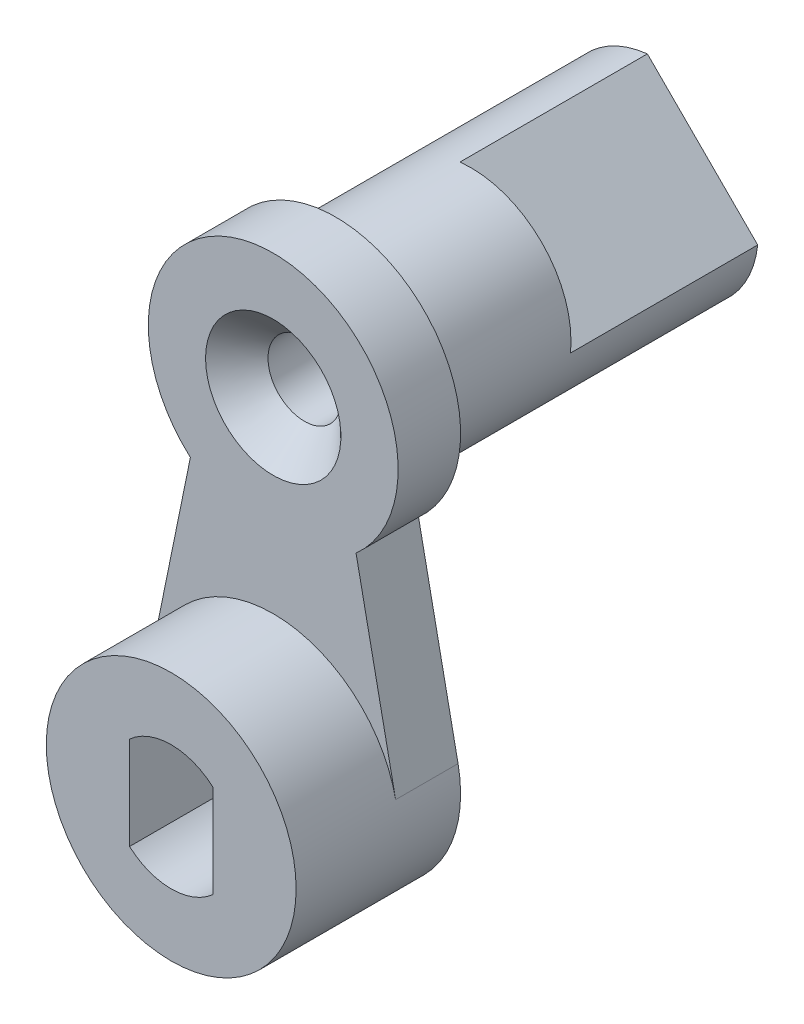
ISO-10303-21;
HEADER;
FILE_DESCRIPTION(('STEP AP214'),'2;1');
FILE_NAME('part.step','',(''),(''),'','','');
FILE_SCHEMA(('AUTOMOTIVE_DESIGN { 1 0 10303 214 1 1 1 1 }'));
ENDSEC;
DATA;
#1=APPLICATION_CONTEXT('core data for automotive mechanical design processes');
#2=APPLICATION_PROTOCOL_DEFINITION('international standard','automotive_design',2000,#1);
#3=PRODUCT_CONTEXT('',#1,'mechanical');
#4=PRODUCT('Part','Part','',(#3));
#5=PRODUCT_RELATED_PRODUCT_CATEGORY('part','',(#4));
#6=PRODUCT_DEFINITION_FORMATION('','',#4);
#7=PRODUCT_DEFINITION_CONTEXT('part definition',#1,'design');
#8=PRODUCT_DEFINITION('design','',#6,#7);
#9=PRODUCT_DEFINITION_SHAPE('','',#8);
#10=(LENGTH_UNIT() NAMED_UNIT(*) SI_UNIT(.MILLI.,.METRE.));
#11=(NAMED_UNIT(*) PLANE_ANGLE_UNIT() SI_UNIT($,.RADIAN.));
#12=(NAMED_UNIT(*) SI_UNIT($,.STERADIAN.) SOLID_ANGLE_UNIT());
#13=UNCERTAINTY_MEASURE_WITH_UNIT(LENGTH_MEASURE(1.E-05),#10,'distance_accuracy_value','');
#14=(GEOMETRIC_REPRESENTATION_CONTEXT(3) GLOBAL_UNCERTAINTY_ASSIGNED_CONTEXT((#13)) GLOBAL_UNIT_ASSIGNED_CONTEXT((#10,
#11,#12)) REPRESENTATION_CONTEXT('',''));
#15=CARTESIAN_POINT('',(0.,0.,0.));
#16=DIRECTION('',(0.,0.,1.));
#17=DIRECTION('',(1.,0.,0.));
#18=AXIS2_PLACEMENT_3D('',#15,#16,#17);
#19=CARTESIAN_POINT('',(0.,15.,-6.5));
#20=DIRECTION('',(0.,0.,-1.));
#21=DIRECTION('',(-1.,0.,0.));
#22=AXIS2_PLACEMENT_3D('',#19,#20,#21);
#23=PLANE('',#22);
#24=CARTESIAN_POINT('',(0.,15.,-6.5));
#25=DIRECTION('',(0.,0.,-1.));
#26=DIRECTION('',(-1.,0.,0.));
#27=AXIS2_PLACEMENT_3D('',#24,#25,#26);
#28=CIRCLE('',#27,4.8);
#29=CARTESIAN_POINT('',(-0.528207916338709,19.770848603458,-6.5));
#30=VERTEX_POINT('',#29);
#31=CARTESIAN_POINT('',(4.770848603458,14.4717920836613,-6.5));
#32=VERTEX_POINT('',#31);
#33=EDGE_CURVE('E58',#30,#32,#28,.T.);
#34=ORIENTED_EDGE('',*,*,#33,.T.);
#35=DIRECTION('',(-0.707106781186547,0.707106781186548,0.));
#36=VECTOR('',#35,1.);
#37=CARTESIAN_POINT('',(9.62132034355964,9.62132034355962,-6.5));
#38=LINE('',#37,#36);
#39=EDGE_CURVE('E145',#32,#30,#38,.T.);
#40=ORIENTED_EDGE('',*,*,#39,.T.);
#41=EDGE_LOOP('',(#34,#40));
#42=FACE_BOUND('',#41,.T.);
#43=ADVANCED_FACE('F36',(#42),#23,.T.);
#44=CARTESIAN_POINT('',(0.,0.,0.));
#45=DIRECTION('',(0.,0.,1.));
#46=DIRECTION('',(1.,0.,0.));
#47=AXIS2_PLACEMENT_3D('',#44,#45,#46);
#48=PLANE('',#47);
#49=CARTESIAN_POINT('',(0.,0.,0.));
#50=DIRECTION('',(0.,0.,1.));
#51=DIRECTION('',(1.,0.,0.));
#52=AXIS2_PLACEMENT_3D('',#49,#50,#51);
#53=CIRCLE('',#52,3.);
#54=CARTESIAN_POINT('',(2.,2.23606797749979,0.));
#55=VERTEX_POINT('',#54);
#56=CARTESIAN_POINT('',(-2.,2.23606797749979,0.));
#57=VERTEX_POINT('',#56);
#58=EDGE_CURVE('E179',#55,#57,#53,.T.);
#59=ORIENTED_EDGE('',*,*,#58,.T.);
#60=DIRECTION('',(0.,-1.,0.));
#61=VECTOR('',#60,1.);
#62=CARTESIAN_POINT('',(-2.,2.23606797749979,0.));
#63=LINE('',#62,#61);
#64=CARTESIAN_POINT('',(-2.,-2.23606797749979,0.));
#65=VERTEX_POINT('',#64);
#66=EDGE_CURVE('E200',#57,#65,#63,.T.);
#67=ORIENTED_EDGE('',*,*,#66,.T.);
#68=CARTESIAN_POINT('',(0.,0.,0.));
#69=DIRECTION('',(0.,0.,1.));
#70=DIRECTION('',(1.,0.,0.));
#71=AXIS2_PLACEMENT_3D('',#68,#69,#70);
#72=CIRCLE('',#71,3.);
#73=CARTESIAN_POINT('',(2.,-2.23606797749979,0.));
#74=VERTEX_POINT('',#73);
#75=EDGE_CURVE('E203',#65,#74,#72,.T.);
#76=ORIENTED_EDGE('',*,*,#75,.T.);
#77=DIRECTION('',(0.,1.,0.));
#78=VECTOR('',#77,1.);
#79=CARTESIAN_POINT('',(2.,2.23606797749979,0.));
#80=LINE('',#79,#78);
#81=EDGE_CURVE('E190',#74,#55,#80,.T.);
#82=ORIENTED_EDGE('',*,*,#81,.T.);
#83=EDGE_LOOP('',(#59,#67,#76,#82));
#84=FACE_BOUND('',#83,.T.);
#85=CARTESIAN_POINT('',(0.,0.,0.));
#86=DIRECTION('',(0.,0.,1.));
#87=DIRECTION('',(1.,0.,0.));
#88=AXIS2_PLACEMENT_3D('',#85,#86,#87);
#89=CIRCLE('',#88,6.);
#90=CARTESIAN_POINT('',(-5.87861812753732,1.2007701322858,0.));
#91=VERTEX_POINT('',#90);
#92=CARTESIAN_POINT('',(5.87861812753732,1.2007701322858,0.));
#93=VERTEX_POINT('',#92);
#94=EDGE_CURVE('E217',#91,#93,#89,.T.);
#95=ORIENTED_EDGE('',*,*,#94,.F.);
#96=DIRECTION('',(0.199999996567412,0.979795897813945,0.));
#97=VECTOR('',#96,1.);
#98=CARTESIAN_POINT('',(-5.87877533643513,1.1999999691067,0.));
#99=LINE('',#98,#97);
#100=CARTESIAN_POINT('',(-3.97861816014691,10.5088311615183,0.));
#101=VERTEX_POINT('',#100);
#102=EDGE_CURVE('E172',#91,#101,#99,.T.);
#103=ORIENTED_EDGE('',*,*,#102,.T.);
#104=CARTESIAN_POINT('',(0.,15.,0.));
#105=DIRECTION('',(0.,0.,-1.));
#106=DIRECTION('',(-1.,0.,0.));
#107=AXIS2_PLACEMENT_3D('',#104,#105,#106);
#108=CIRCLE('',#107,6.);
#109=CARTESIAN_POINT('',(3.97861816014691,10.5088311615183,0.));
#110=VERTEX_POINT('',#109);
#111=EDGE_CURVE('E159',#101,#110,#108,.T.);
#112=ORIENTED_EDGE('',*,*,#111,.T.);
#113=DIRECTION('',(-0.199999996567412,0.979795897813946,0.));
#114=VECTOR('',#113,1.);
#115=CARTESIAN_POINT('',(5.87877533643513,1.1999999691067,0.));
#116=LINE('',#115,#114);
#117=EDGE_CURVE('E169',#93,#110,#116,.T.);
#118=ORIENTED_EDGE('',*,*,#117,.F.);
#119=EDGE_LOOP('',(#95,#103,#112,#118));
#120=FACE_BOUND('',#119,.T.);
#121=CARTESIAN_POINT('',(0.,15.,0.));
#122=DIRECTION('',(0.,0.,1.));
#123=DIRECTION('',(1.,0.,0.));
#124=AXIS2_PLACEMENT_3D('',#121,#122,#123);
#125=CIRCLE('',#124,4.8);
#126=CARTESIAN_POINT('',(4.8,15.,0.));
#127=VERTEX_POINT('',#126);
#128=EDGE_CURVE('E221',#127,#127,#125,.F.);
#129=ORIENTED_EDGE('',*,*,#128,.F.);
#130=EDGE_LOOP('',(#129));
#131=FACE_BOUND('',#130,.T.);
#132=ADVANCED_FACE('F239',(#84,#120,#131),#48,.F.);
#133=CARTESIAN_POINT('',(0.,0.,7.9));
#134=DIRECTION('',(0.,0.,1.));
#135=DIRECTION('',(1.,0.,0.));
#136=AXIS2_PLACEMENT_3D('',#133,#134,#135);
#137=PLANE('',#136);
#138=CARTESIAN_POINT('',(0.,0.,7.9));
#139=DIRECTION('',(0.,0.,1.));
#140=DIRECTION('',(1.,0.,0.));
#141=AXIS2_PLACEMENT_3D('',#138,#139,#140);
#142=CIRCLE('',#141,6.);
#143=CARTESIAN_POINT('',(6.,0.,7.9));
#144=VERTEX_POINT('',#143);
#145=EDGE_CURVE('E218',#144,#144,#142,.T.);
#146=ORIENTED_EDGE('',*,*,#145,.T.);
#147=EDGE_LOOP('',(#146));
#148=FACE_BOUND('',#147,.T.);
#149=DIRECTION('',(0.,-1.,0.));
#150=VECTOR('',#149,1.);
#151=CARTESIAN_POINT('',(-2.,2.23606797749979,7.9));
#152=LINE('',#151,#150);
#153=CARTESIAN_POINT('',(-2.,2.23606797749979,7.9));
#154=VERTEX_POINT('',#153);
#155=CARTESIAN_POINT('',(-2.,-2.23606797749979,7.9));
#156=VERTEX_POINT('',#155);
#157=EDGE_CURVE('E189',#154,#156,#152,.T.);
#158=ORIENTED_EDGE('',*,*,#157,.F.);
#159=CARTESIAN_POINT('',(0.,0.,7.9));
#160=DIRECTION('',(0.,0.,1.));
#161=DIRECTION('',(1.,0.,0.));
#162=AXIS2_PLACEMENT_3D('',#159,#160,#161);
#163=CIRCLE('',#162,3.);
#164=CARTESIAN_POINT('',(2.,2.23606797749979,7.9));
#165=VERTEX_POINT('',#164);
#166=EDGE_CURVE('E187',#165,#154,#163,.T.);
#167=ORIENTED_EDGE('',*,*,#166,.F.);
#168=DIRECTION('',(0.,1.,0.));
#169=VECTOR('',#168,1.);
#170=CARTESIAN_POINT('',(2.,2.23606797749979,7.9));
#171=LINE('',#170,#169);
#172=CARTESIAN_POINT('',(2.,-2.23606797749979,7.9));
#173=VERTEX_POINT('',#172);
#174=EDGE_CURVE('E195',#173,#165,#171,.T.);
#175=ORIENTED_EDGE('',*,*,#174,.F.);
#176=CARTESIAN_POINT('',(0.,0.,7.9));
#177=DIRECTION('',(0.,0.,1.));
#178=DIRECTION('',(1.,0.,0.));
#179=AXIS2_PLACEMENT_3D('',#176,#177,#178);
#180=CIRCLE('',#179,3.);
#181=EDGE_CURVE('E192',#156,#173,#180,.T.);
#182=ORIENTED_EDGE('',*,*,#181,.F.);
#183=EDGE_LOOP('',(#158,#167,#175,#182));
#184=FACE_BOUND('',#183,.T.);
#185=ADVANCED_FACE('F245',(#148,#184),#137,.T.);
#186=CARTESIAN_POINT('',(0.,0.,7.9));
#187=DIRECTION('',(0.,0.,-1.));
#188=DIRECTION('',(-1.,0.,0.));
#189=AXIS2_PLACEMENT_3D('',#186,#187,#188);
#190=CYLINDRICAL_SURFACE('',#189,6.);
#191=CARTESIAN_POINT('',(0.,0.,3.));
#192=DIRECTION('',(0.,0.,-1.));
#193=DIRECTION('',(-1.,0.,0.));
#194=AXIS2_PLACEMENT_3D('',#191,#192,#193);
#195=CIRCLE('',#194,6.);
#196=CARTESIAN_POINT('',(-5.87861812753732,1.2007701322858,3.));
#197=VERTEX_POINT('',#196);
#198=CARTESIAN_POINT('',(5.87861812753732,1.2007701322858,3.));
#199=VERTEX_POINT('',#198);
#200=EDGE_CURVE('E158',#197,#199,#195,.T.);
#201=ORIENTED_EDGE('',*,*,#200,.F.);
#202=DIRECTION('',(0.,0.,-1.));
#203=VECTOR('',#202,1.);
#204=CARTESIAN_POINT('',(-5.87861812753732,1.2007701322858,3.));
#205=LINE('',#204,#203);
#206=EDGE_CURVE('E182',#197,#91,#205,.T.);
#207=ORIENTED_EDGE('',*,*,#206,.T.);
#208=ORIENTED_EDGE('',*,*,#94,.T.);
#209=DIRECTION('',(0.,0.,-1.));
#210=VECTOR('',#209,1.);
#211=CARTESIAN_POINT('',(5.87861812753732,1.2007701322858,3.));
#212=LINE('',#211,#210);
#213=EDGE_CURVE('E168',#199,#93,#212,.T.);
#214=ORIENTED_EDGE('',*,*,#213,.F.);
#215=EDGE_LOOP('',(#201,#207,#208,#214));
#216=FACE_BOUND('',#215,.T.);
#217=ORIENTED_EDGE('',*,*,#145,.F.);
#218=EDGE_LOOP('',(#217));
#219=FACE_BOUND('',#218,.T.);
#220=ADVANCED_FACE('F290',(#216,#219),#190,.T.);
#221=CARTESIAN_POINT('',(0.,0.,7.9));
#222=DIRECTION('',(0.,0.,-1.));
#223=DIRECTION('',(-1.,0.,0.));
#224=AXIS2_PLACEMENT_3D('',#221,#222,#223);
#225=CYLINDRICAL_SURFACE('',#224,3.);
#226=ORIENTED_EDGE('',*,*,#58,.F.);
#227=DIRECTION('',(0.,0.,-1.));
#228=VECTOR('',#227,1.);
#229=CARTESIAN_POINT('',(2.,2.23606797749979,7.9));
#230=LINE('',#229,#228);
#231=EDGE_CURVE('E197',#165,#55,#230,.T.);
#232=ORIENTED_EDGE('',*,*,#231,.F.);
#233=ORIENTED_EDGE('',*,*,#166,.T.);
#234=DIRECTION('',(0.,0.,-1.));
#235=VECTOR('',#234,1.);
#236=CARTESIAN_POINT('',(-2.,2.23606797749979,7.9));
#237=LINE('',#236,#235);
#238=EDGE_CURVE('E214',#154,#57,#237,.T.);
#239=ORIENTED_EDGE('',*,*,#238,.T.);
#240=EDGE_LOOP('',(#226,#232,#233,#239));
#241=FACE_BOUND('',#240,.T.);
#242=ADVANCED_FACE('F286',(#241),#225,.F.);
#243=CARTESIAN_POINT('',(-2.,2.23606797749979,7.9));
#244=DIRECTION('',(1.,0.,0.));
#245=DIRECTION('',(0.,0.,-1.));
#246=AXIS2_PLACEMENT_3D('',#243,#244,#245);
#247=PLANE('',#246);
#248=ORIENTED_EDGE('',*,*,#66,.F.);
#249=ORIENTED_EDGE('',*,*,#238,.F.);
#250=ORIENTED_EDGE('',*,*,#157,.T.);
#251=DIRECTION('',(0.,0.,-1.));
#252=VECTOR('',#251,1.);
#253=CARTESIAN_POINT('',(-2.,-2.23606797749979,7.9));
#254=LINE('',#253,#252);
#255=EDGE_CURVE('E212',#156,#65,#254,.T.);
#256=ORIENTED_EDGE('',*,*,#255,.T.);
#257=EDGE_LOOP('',(#248,#249,#250,#256));
#258=FACE_BOUND('',#257,.T.);
#259=ADVANCED_FACE('F282',(#258),#247,.T.);
#260=CARTESIAN_POINT('',(0.,0.,7.9));
#261=DIRECTION('',(0.,0.,-1.));
#262=DIRECTION('',(-1.,0.,0.));
#263=AXIS2_PLACEMENT_3D('',#260,#261,#262);
#264=CYLINDRICAL_SURFACE('',#263,3.);
#265=ORIENTED_EDGE('',*,*,#75,.F.);
#266=ORIENTED_EDGE('',*,*,#255,.F.);
#267=ORIENTED_EDGE('',*,*,#181,.T.);
#268=DIRECTION('',(0.,0.,-1.));
#269=VECTOR('',#268,1.);
#270=CARTESIAN_POINT('',(2.,-2.23606797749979,7.9));
#271=LINE('',#270,#269);
#272=EDGE_CURVE('E210',#173,#74,#271,.T.);
#273=ORIENTED_EDGE('',*,*,#272,.T.);
#274=EDGE_LOOP('',(#265,#266,#267,#273));
#275=FACE_BOUND('',#274,.T.);
#276=ADVANCED_FACE('F278',(#275),#264,.F.);
#277=CARTESIAN_POINT('',(2.,2.23606797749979,7.9));
#278=DIRECTION('',(-1.,0.,0.));
#279=DIRECTION('',(0.,0.,1.));
#280=AXIS2_PLACEMENT_3D('',#277,#278,#279);
#281=PLANE('',#280);
#282=ORIENTED_EDGE('',*,*,#81,.F.);
#283=ORIENTED_EDGE('',*,*,#272,.F.);
#284=ORIENTED_EDGE('',*,*,#174,.T.);
#285=ORIENTED_EDGE('',*,*,#231,.T.);
#286=EDGE_LOOP('',(#282,#283,#284,#285));
#287=FACE_BOUND('',#286,.T.);
#288=ADVANCED_FACE('F273',(#287),#281,.T.);
#289=CARTESIAN_POINT('',(5.87877533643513,1.1999999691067,3.));
#290=DIRECTION('',(-0.979795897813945,-0.199999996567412,0.));
#291=DIRECTION('',(0.199999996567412,-0.979795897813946,0.));
#292=AXIS2_PLACEMENT_3D('',#289,#290,#291);
#293=PLANE('',#292);
#294=ORIENTED_EDGE('',*,*,#117,.T.);
#295=DIRECTION('',(0.,0.,-1.));
#296=VECTOR('',#295,1.);
#297=CARTESIAN_POINT('',(3.97861816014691,10.5088311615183,3.));
#298=LINE('',#297,#296);
#299=CARTESIAN_POINT('',(3.97861816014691,10.5088311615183,3.));
#300=VERTEX_POINT('',#299);
#301=EDGE_CURVE('E177',#300,#110,#298,.T.);
#302=ORIENTED_EDGE('',*,*,#301,.F.);
#303=DIRECTION('',(-0.199999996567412,0.979795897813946,0.));
#304=VECTOR('',#303,1.);
#305=CARTESIAN_POINT('',(5.87877533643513,1.1999999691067,3.));
#306=LINE('',#305,#304);
#307=EDGE_CURVE('E156',#199,#300,#306,.T.);
#308=ORIENTED_EDGE('',*,*,#307,.F.);
#309=ORIENTED_EDGE('',*,*,#213,.T.);
#310=EDGE_LOOP('',(#294,#302,#308,#309));
#311=FACE_BOUND('',#310,.T.);
#312=ADVANCED_FACE('F267',(#311),#293,.F.);
#313=CARTESIAN_POINT('',(0.,15.,3.));
#314=DIRECTION('',(0.,0.,-1.));
#315=DIRECTION('',(-1.,0.,0.));
#316=AXIS2_PLACEMENT_3D('',#313,#314,#315);
#317=CYLINDRICAL_SURFACE('',#316,6.);
#318=ORIENTED_EDGE('',*,*,#111,.F.);
#319=DIRECTION('',(0.,0.,-1.));
#320=VECTOR('',#319,1.);
#321=CARTESIAN_POINT('',(-3.97861816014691,10.5088311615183,3.));
#322=LINE('',#321,#320);
#323=CARTESIAN_POINT('',(-3.97861816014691,10.5088311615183,3.));
#324=VERTEX_POINT('',#323);
#325=EDGE_CURVE('E180',#324,#101,#322,.T.);
#326=ORIENTED_EDGE('',*,*,#325,.F.);
#327=CARTESIAN_POINT('',(0.,15.,3.));
#328=DIRECTION('',(0.,0.,-1.));
#329=DIRECTION('',(-1.,0.,0.));
#330=AXIS2_PLACEMENT_3D('',#327,#328,#329);
#331=CIRCLE('',#330,6.);
#332=EDGE_CURVE('E165',#324,#300,#331,.T.);
#333=ORIENTED_EDGE('',*,*,#332,.T.);
#334=ORIENTED_EDGE('',*,*,#301,.T.);
#335=EDGE_LOOP('',(#318,#326,#333,#334));
#336=FACE_BOUND('',#335,.T.);
#337=ADVANCED_FACE('F264',(#336),#317,.T.);
#338=CARTESIAN_POINT('',(-5.87877533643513,1.1999999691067,3.));
#339=DIRECTION('',(-0.979795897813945,0.199999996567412,0.));
#340=DIRECTION('',(-0.199999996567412,-0.979795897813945,0.));
#341=AXIS2_PLACEMENT_3D('',#338,#339,#340);
#342=PLANE('',#341);
#343=ORIENTED_EDGE('',*,*,#102,.F.);
#344=ORIENTED_EDGE('',*,*,#206,.F.);
#345=DIRECTION('',(0.199999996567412,0.979795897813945,0.));
#346=VECTOR('',#345,1.);
#347=CARTESIAN_POINT('',(-5.87877533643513,1.1999999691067,3.));
#348=LINE('',#347,#346);
#349=EDGE_CURVE('E162',#197,#324,#348,.T.);
#350=ORIENTED_EDGE('',*,*,#349,.T.);
#351=ORIENTED_EDGE('',*,*,#325,.T.);
#352=EDGE_LOOP('',(#343,#344,#350,#351));
#353=FACE_BOUND('',#352,.T.);
#354=ADVANCED_FACE('F260',(#353),#342,.T.);
#355=CARTESIAN_POINT('',(0.,15.,3.));
#356=DIRECTION('',(0.,0.,-1.));
#357=DIRECTION('',(-1.,0.,0.));
#358=AXIS2_PLACEMENT_3D('',#355,#356,#357);
#359=CYLINDRICAL_SURFACE('',#358,1.75);
#360=CARTESIAN_POINT('',(0.,15.,1.5));
#361=DIRECTION('',(0.,0.,-1.));
#362=DIRECTION('',(-1.,0.,0.));
#363=AXIS2_PLACEMENT_3D('',#360,#361,#362);
#364=CIRCLE('',#363,1.75);
#365=CARTESIAN_POINT('',(-1.75,15.,1.5));
#366=VERTEX_POINT('',#365);
#367=EDGE_CURVE('E11',#366,#366,#364,.F.);
#368=ORIENTED_EDGE('',*,*,#367,.T.);
#369=EDGE_LOOP('',(#368));
#370=FACE_BOUND('',#369,.T.);
#371=CARTESIAN_POINT('',(0.,15.,-15.5));
#372=DIRECTION('',(0.,0.,-1.));
#373=DIRECTION('',(-1.,0.,0.));
#374=AXIS2_PLACEMENT_3D('',#371,#372,#373);
#375=CIRCLE('',#374,1.75);
#376=CARTESIAN_POINT('',(-1.75,15.,-15.5));
#377=VERTEX_POINT('',#376);
#378=EDGE_CURVE('E467',#377,#377,#375,.F.);
#379=ORIENTED_EDGE('',*,*,#378,.F.);
#380=EDGE_LOOP('',(#379));
#381=FACE_BOUND('',#380,.T.);
#382=ADVANCED_FACE('F255',(#370,#381),#359,.F.);
#383=CARTESIAN_POINT('',(0.,0.,3.));
#384=DIRECTION('',(0.,0.,-1.));
#385=DIRECTION('',(-1.,0.,0.));
#386=AXIS2_PLACEMENT_3D('',#383,#384,#385);
#387=PLANE('',#386);
#388=CARTESIAN_POINT('',(0.,15.,3.));
#389=DIRECTION('',(0.,0.,-1.));
#390=DIRECTION('',(-1.,0.,0.));
#391=AXIS2_PLACEMENT_3D('',#388,#389,#390);
#392=CIRCLE('',#391,3.24999999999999);
#393=CARTESIAN_POINT('',(-3.24999999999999,15.,3.));
#394=VERTEX_POINT('',#393);
#395=EDGE_CURVE('E45',#394,#394,#392,.T.);
#396=ORIENTED_EDGE('',*,*,#395,.T.);
#397=EDGE_LOOP('',(#396));
#398=FACE_BOUND('',#397,.T.);
#399=ORIENTED_EDGE('',*,*,#307,.T.);
#400=ORIENTED_EDGE('',*,*,#332,.F.);
#401=ORIENTED_EDGE('',*,*,#349,.F.);
#402=ORIENTED_EDGE('',*,*,#200,.T.);
#403=EDGE_LOOP('',(#399,#400,#401,#402));
#404=FACE_BOUND('',#403,.T.);
#405=ADVANCED_FACE('F227',(#398,#404),#387,.F.);
#406=DIRECTION('',(-0.707106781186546,0.70710678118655,0.));
#407=VECTOR('',#406,1.);
#408=CARTESIAN_POINT('',(5.37867965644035,5.37867965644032,-6.5));
#409=LINE('',#408,#407);
#410=CARTESIAN_POINT('',(0.528207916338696,10.229151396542,-6.5));
#411=VERTEX_POINT('',#410);
#412=CARTESIAN_POINT('',(-4.77084860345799,15.5282079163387,-6.5));
#413=VERTEX_POINT('',#412);
#414=EDGE_CURVE('E51',#411,#413,#409,.T.);
#415=ORIENTED_EDGE('',*,*,#414,.F.);
#416=EDGE_CURVE('E149',#411,#413,#28,.T.);
#417=ORIENTED_EDGE('',*,*,#416,.T.);
#418=EDGE_LOOP('',(#415,#417));
#419=FACE_BOUND('',#418,.T.);
#420=ADVANCED_FACE('F241',(#419),#23,.T.);
#421=CARTESIAN_POINT('',(0.,15.,-6.5));
#422=DIRECTION('',(0.,0.,1.));
#423=DIRECTION('',(1.,0.,0.));
#424=AXIS2_PLACEMENT_3D('',#421,#422,#423);
#425=CYLINDRICAL_SURFACE('',#424,4.8);
#426=ORIENTED_EDGE('',*,*,#33,.F.);
#427=DIRECTION('',(0.,0.,1.));
#428=VECTOR('',#427,1.);
#429=CARTESIAN_POINT('',(-0.528207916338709,19.770848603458,-15.5));
#430=LINE('',#429,#428);
#431=CARTESIAN_POINT('',(-0.528207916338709,19.770848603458,-15.5));
#432=VERTEX_POINT('',#431);
#433=EDGE_CURVE('E152',#432,#30,#430,.T.);
#434=ORIENTED_EDGE('',*,*,#433,.F.);
#435=CARTESIAN_POINT('',(0.,15.,-15.5));
#436=DIRECTION('',(0.,0.,-1.));
#437=DIRECTION('',(-1.,0.,0.));
#438=AXIS2_PLACEMENT_3D('',#435,#436,#437);
#439=CIRCLE('',#438,4.8);
#440=CARTESIAN_POINT('',(-4.77084860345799,15.5282079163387,-15.5));
#441=VERTEX_POINT('',#440);
#442=EDGE_CURVE('E135',#441,#432,#439,.T.);
#443=ORIENTED_EDGE('',*,*,#442,.F.);
#444=DIRECTION('',(0.,0.,1.));
#445=VECTOR('',#444,1.);
#446=CARTESIAN_POINT('',(-4.77084860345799,15.5282079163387,-15.5));
#447=LINE('',#446,#445);
#448=EDGE_CURVE('E132',#441,#413,#447,.T.);
#449=ORIENTED_EDGE('',*,*,#448,.T.);
#450=ORIENTED_EDGE('',*,*,#416,.F.);
#451=DIRECTION('',(0.,0.,1.));
#452=VECTOR('',#451,1.);
#453=CARTESIAN_POINT('',(0.528207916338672,10.229151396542,-15.5));
#454=LINE('',#453,#452);
#455=CARTESIAN_POINT('',(0.528207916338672,10.229151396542,-15.5));
#456=VERTEX_POINT('',#455);
#457=EDGE_CURVE('E130',#456,#411,#454,.T.);
#458=ORIENTED_EDGE('',*,*,#457,.F.);
#459=CARTESIAN_POINT('',(0.,15.,-15.5));
#460=DIRECTION('',(0.,0.,-1.));
#461=DIRECTION('',(-1.,0.,0.));
#462=AXIS2_PLACEMENT_3D('',#459,#460,#461);
#463=CIRCLE('',#462,4.8);
#464=CARTESIAN_POINT('',(4.770848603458,14.4717920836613,-15.5));
#465=VERTEX_POINT('',#464);
#466=EDGE_CURVE('E136',#465,#456,#463,.T.);
#467=ORIENTED_EDGE('',*,*,#466,.F.);
#468=DIRECTION('',(0.,0.,1.));
#469=VECTOR('',#468,1.);
#470=CARTESIAN_POINT('',(4.770848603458,14.4717920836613,-15.5));
#471=LINE('',#470,#469);
#472=EDGE_CURVE('E461',#465,#32,#471,.T.);
#473=ORIENTED_EDGE('',*,*,#472,.T.);
#474=EDGE_LOOP('',(#426,#434,#443,#449,#450,#458,#467,#473));
#475=FACE_BOUND('',#474,.T.);
#476=ORIENTED_EDGE('',*,*,#128,.T.);
#477=EDGE_LOOP('',(#476));
#478=FACE_BOUND('',#477,.T.);
#479=ADVANCED_FACE('F147',(#475,#478),#425,.T.);
#480=CARTESIAN_POINT('',(5.37867965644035,5.37867965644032,-15.5));
#481=DIRECTION('',(0.70710678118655,0.707106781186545,0.));
#482=DIRECTION('',(-0.707106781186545,0.70710678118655,0.));
#483=AXIS2_PLACEMENT_3D('',#480,#481,#482);
#484=PLANE('',#483);
#485=ORIENTED_EDGE('',*,*,#414,.T.);
#486=ORIENTED_EDGE('',*,*,#448,.F.);
#487=DIRECTION('',(-0.707106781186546,0.70710678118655,0.));
#488=VECTOR('',#487,1.);
#489=CARTESIAN_POINT('',(5.37867965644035,5.37867965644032,-15.5));
#490=LINE('',#489,#488);
#491=EDGE_CURVE('E126',#456,#441,#490,.T.);
#492=ORIENTED_EDGE('',*,*,#491,.F.);
#493=ORIENTED_EDGE('',*,*,#457,.T.);
#494=EDGE_LOOP('',(#485,#486,#492,#493));
#495=FACE_BOUND('',#494,.T.);
#496=ADVANCED_FACE('F128',(#495),#484,.F.);
#497=CARTESIAN_POINT('',(9.62132034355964,9.62132034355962,-15.5));
#498=DIRECTION('',(0.707106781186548,0.707106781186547,0.));
#499=DIRECTION('',(-0.707106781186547,0.707106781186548,0.));
#500=AXIS2_PLACEMENT_3D('',#497,#498,#499);
#501=PLANE('',#500);
#502=ORIENTED_EDGE('',*,*,#39,.F.);
#503=ORIENTED_EDGE('',*,*,#472,.F.);
#504=DIRECTION('',(-0.707106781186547,0.707106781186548,0.));
#505=VECTOR('',#504,1.);
#506=CARTESIAN_POINT('',(9.62132034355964,9.62132034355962,-15.5));
#507=LINE('',#506,#505);
#508=EDGE_CURVE('E143',#465,#432,#507,.T.);
#509=ORIENTED_EDGE('',*,*,#508,.T.);
#510=ORIENTED_EDGE('',*,*,#433,.T.);
#511=EDGE_LOOP('',(#502,#503,#509,#510));
#512=FACE_BOUND('',#511,.T.);
#513=ADVANCED_FACE('F235',(#512),#501,.T.);
#514=CARTESIAN_POINT('',(0.,0.,-15.5));
#515=DIRECTION('',(0.,0.,-1.));
#516=DIRECTION('',(-1.,0.,0.));
#517=AXIS2_PLACEMENT_3D('',#514,#515,#516);
#518=PLANE('',#517);
#519=ORIENTED_EDGE('',*,*,#466,.T.);
#520=ORIENTED_EDGE('',*,*,#491,.T.);
#521=ORIENTED_EDGE('',*,*,#442,.T.);
#522=ORIENTED_EDGE('',*,*,#508,.F.);
#523=EDGE_LOOP('',(#519,#520,#521,#522));
#524=FACE_BOUND('',#523,.T.);
#525=ORIENTED_EDGE('',*,*,#378,.T.);
#526=EDGE_LOOP('',(#525));
#527=FACE_BOUND('',#526,.T.);
#528=ADVANCED_FACE('F140',(#524,#527),#518,.T.);
#529=CARTESIAN_POINT('',(0.,15.,3.));
#530=DIRECTION('',(0.,0.,1.));
#531=DIRECTION('',(1.,0.,0.));
#532=AXIS2_PLACEMENT_3D('',#529,#530,#531);
#533=CONICAL_SURFACE('',#532,3.24999999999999,0.785398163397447);
#534=ORIENTED_EDGE('',*,*,#367,.F.);
#535=EDGE_LOOP('',(#534));
#536=FACE_BOUND('',#535,.T.);
#537=ORIENTED_EDGE('',*,*,#395,.F.);
#538=EDGE_LOOP('',(#537));
#539=FACE_BOUND('',#538,.T.);
#540=ADVANCED_FACE('F39',(#536,#539),#533,.F.);
#541=CLOSED_SHELL('',(#43,#132,#185,#220,#242,#259,#276,#288,#312,#337,#354,#382,#405,#420,#479,
#496,#513,#528,#540));
#542=MANIFOLD_SOLID_BREP('B2',#541);
#543=ADVANCED_BREP_SHAPE_REPRESENTATION('',(#18,#542),#14);
#544=SHAPE_DEFINITION_REPRESENTATION(#9,#543);
ENDSEC;
END-ISO-10303-21;
